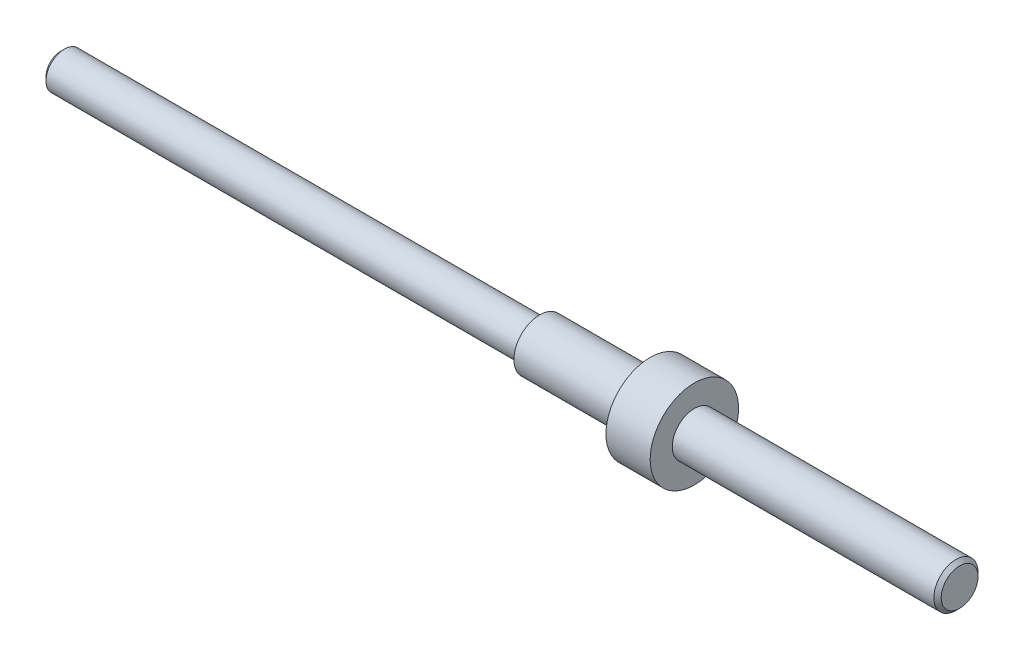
from build123d import *

# Parameters (mm, degrees)
CHANFREIN1_SIZE = 0.5


with BuildPart() as part:
    # Esquisse1 → R_volution1 (revolve)
    with BuildSketch(Plane.XY, mode=Mode.PRIVATE) as r_volution1_sk:
        Polygon((0, 0), (0, 3), (-36, 3), (-36, 6), (-42, 6), (-42, 3.5), (-57, 3.5), (-57, 2.5), (-122, 2.5), (-122, 0), align=None)
    revolve(r_volution1_sk.sketch.rotate(Axis((-122, 0, 0), (1, 0, 0)), 90), axis=Axis((-122, 0, 0), (1, 0, 0)))

    # Chanfrein1
    chanfrein1_edges = [part.edges().sort_by_distance(p)[0] for p in [
        (-122, 0, -2.5),
        (0, 0, -3),
    ]]
    chamfer(chanfrein1_edges, length=CHANFREIN1_SIZE)


solid = part.part
